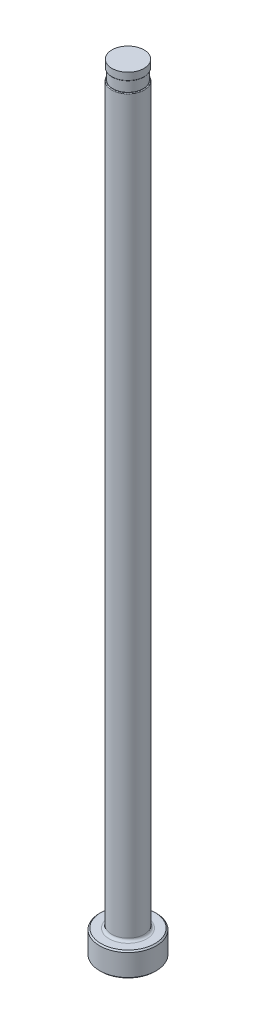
ISO-10303-21;
HEADER;
FILE_DESCRIPTION(('STEP AP214'),'2;1');
FILE_NAME('part.step','',(''),(''),'','','');
FILE_SCHEMA(('AUTOMOTIVE_DESIGN { 1 0 10303 214 1 1 1 1 }'));
ENDSEC;
DATA;
#1=APPLICATION_CONTEXT('core data for automotive mechanical design processes');
#2=APPLICATION_PROTOCOL_DEFINITION('international standard','automotive_design',2000,#1);
#3=PRODUCT_CONTEXT('',#1,'mechanical');
#4=PRODUCT('Part','Part','',(#3));
#5=PRODUCT_RELATED_PRODUCT_CATEGORY('part','',(#4));
#6=PRODUCT_DEFINITION_FORMATION('','',#4);
#7=PRODUCT_DEFINITION_CONTEXT('part definition',#1,'design');
#8=PRODUCT_DEFINITION('design','',#6,#7);
#9=PRODUCT_DEFINITION_SHAPE('','',#8);
#10=(LENGTH_UNIT() NAMED_UNIT(*) SI_UNIT(.MILLI.,.METRE.));
#11=(NAMED_UNIT(*) PLANE_ANGLE_UNIT() SI_UNIT($,.RADIAN.));
#12=(NAMED_UNIT(*) SI_UNIT($,.STERADIAN.) SOLID_ANGLE_UNIT());
#13=UNCERTAINTY_MEASURE_WITH_UNIT(LENGTH_MEASURE(1.E-05),#10,'distance_accuracy_value','');
#14=(GEOMETRIC_REPRESENTATION_CONTEXT(3) GLOBAL_UNCERTAINTY_ASSIGNED_CONTEXT((#13)) GLOBAL_UNIT_ASSIGNED_CONTEXT((#10,
#11,#12)) REPRESENTATION_CONTEXT('',''));
#15=CARTESIAN_POINT('',(0.,0.,0.));
#16=DIRECTION('',(0.,0.,1.));
#17=DIRECTION('',(1.,0.,0.));
#18=AXIS2_PLACEMENT_3D('',#15,#16,#17);
#19=CARTESIAN_POINT('',(-3.17499999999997,150.876,0.));
#20=DIRECTION('',(0.,1.,0.));
#21=DIRECTION('',(0.,0.,1.));
#22=AXIS2_PLACEMENT_3D('',#19,#20,#21);
#23=PLANE('',#22);
#24=CARTESIAN_POINT('',(0.,150.876,0.));
#25=DIRECTION('',(0.,1.,0.));
#26=DIRECTION('',(0.,0.,1.));
#27=AXIS2_PLACEMENT_3D('',#24,#25,#26);
#28=CIRCLE('',#27,3.02259999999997);
#29=CARTESIAN_POINT('',(0.,150.876,3.02259999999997));
#30=VERTEX_POINT('',#29);
#31=EDGE_CURVE('E11',#30,#30,#28,.F.);
#32=ORIENTED_EDGE('',*,*,#31,.T.);
#33=EDGE_LOOP('',(#32));
#34=FACE_BOUND('',#33,.T.);
#35=CARTESIAN_POINT('',(0.,150.876,0.));
#36=DIRECTION('',(0.,1.,0.));
#37=DIRECTION('',(0.,0.,1.));
#38=AXIS2_PLACEMENT_3D('',#35,#36,#37);
#39=CIRCLE('',#38,2.97179999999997);
#40=CARTESIAN_POINT('',(0.,150.876,2.97179999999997));
#41=VERTEX_POINT('',#40);
#42=EDGE_CURVE('E78',#41,#41,#39,.T.);
#43=ORIENTED_EDGE('',*,*,#42,.T.);
#44=EDGE_LOOP('',(#43));
#45=FACE_BOUND('',#44,.T.);
#46=ADVANCED_FACE('F36',(#34,#45),#23,.F.);
#47=CARTESIAN_POINT('',(0.,259.958771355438,0.));
#48=DIRECTION('',(0.,1.,0.));
#49=DIRECTION('',(0.,0.,1.));
#50=AXIS2_PLACEMENT_3D('',#47,#48,#49);
#51=CYLINDRICAL_SURFACE('',#50,3.17499999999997);
#52=DIRECTION('',(0.,1.,0.));
#53=VECTOR('',#52,1.);
#54=CARTESIAN_POINT('',(-2.97179999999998,259.958771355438,-1.11759999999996));
#55=LINE('',#54,#53);
#56=CARTESIAN_POINT('',(-2.97179999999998,148.717,-1.11759999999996));
#57=VERTEX_POINT('',#56);
#58=CARTESIAN_POINT('',(-2.97179999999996,86.36,-1.11760000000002));
#59=VERTEX_POINT('',#58);
#60=EDGE_CURVE('E73',#57,#59,#55,.F.);
#61=ORIENTED_EDGE('',*,*,#60,.F.);
#62=CARTESIAN_POINT('',(0.,148.717,0.));
#63=DIRECTION('',(0.,-1.,0.));
#64=DIRECTION('',(0.,0.,-1.));
#65=AXIS2_PLACEMENT_3D('',#62,#63,#64);
#66=CIRCLE('',#65,3.17499999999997);
#67=CARTESIAN_POINT('',(-2.97179999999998,148.717,1.11759999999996));
#68=VERTEX_POINT('',#67);
#69=EDGE_CURVE('E51',#57,#68,#66,.T.);
#70=ORIENTED_EDGE('',*,*,#69,.T.);
#71=DIRECTION('',(0.,1.,0.));
#72=VECTOR('',#71,1.);
#73=CARTESIAN_POINT('',(-2.97179999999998,259.958771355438,1.11759999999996));
#74=LINE('',#73,#72);
#75=CARTESIAN_POINT('',(-2.97179999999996,86.36,1.11760000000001));
#76=VERTEX_POINT('',#75);
#77=EDGE_CURVE('E84',#76,#68,#74,.T.);
#78=ORIENTED_EDGE('',*,*,#77,.F.);
#79=CARTESIAN_POINT('',(-2.97179999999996,86.36,-1.11760000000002));
#80=CARTESIAN_POINT('',(-2.97179783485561,86.3288492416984,-1.11759841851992));
#81=CARTESIAN_POINT('',(-2.97225900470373,86.2977131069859,-1.11638031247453));
#82=CARTESIAN_POINT('',(-2.97408412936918,86.2356581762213,-1.11151181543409));
#83=CARTESIAN_POINT('',(-2.9754480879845,86.2047393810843,-1.10786141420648));
#84=CARTESIAN_POINT('',(-2.98085437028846,86.1126586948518,-1.09327356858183));
#85=CARTESIAN_POINT('',(-2.98621120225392,86.0521035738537,-1.07869946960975));
#86=CARTESIAN_POINT('',(-2.99989040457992,85.9344361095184,-1.0400472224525));
#87=CARTESIAN_POINT('',(-3.0082151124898,85.877326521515,-1.01596158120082));
#88=CARTESIAN_POINT('',(-3.02694285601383,85.7682418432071,-0.958720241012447));
#89=CARTESIAN_POINT('',(-3.03734492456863,85.7162643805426,-0.925568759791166));
#90=CARTESIAN_POINT('',(-3.0590244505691,85.6192383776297,-0.851164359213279));
#91=CARTESIAN_POINT('',(-3.07029576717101,85.574146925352,-0.809965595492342));
#92=CARTESIAN_POINT('',(-3.09254226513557,85.4916893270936,-0.720370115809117));
#93=CARTESIAN_POINT('',(-3.10351739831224,85.4543244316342,-0.67197223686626));
#94=CARTESIAN_POINT('',(-3.12390298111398,85.3884529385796,-0.569694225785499));
#95=CARTESIAN_POINT('',(-3.13332395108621,85.3598855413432,-0.515855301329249));
#96=CARTESIAN_POINT('',(-3.14970808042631,85.3118047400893,-0.403931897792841));
#97=CARTESIAN_POINT('',(-3.15667118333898,85.2922915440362,-0.345847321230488));
#98=CARTESIAN_POINT('',(-3.16748231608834,85.2624813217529,-0.226501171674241));
#99=CARTESIAN_POINT('',(-3.171300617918,85.2522721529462,-0.16521497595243));
#100=CARTESIAN_POINT('',(-3.17532797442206,85.2415133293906,-0.0416799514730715));
#101=CARTESIAN_POINT('',(-3.17553664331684,85.2409647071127,0.0205689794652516));
#102=CARTESIAN_POINT('',(-3.17230405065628,85.2495855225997,0.145017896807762));
#103=CARTESIAN_POINT('',(-3.16882082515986,85.2588666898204,0.207209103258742));
#104=CARTESIAN_POINT('',(-3.15849643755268,85.2872036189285,0.329033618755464));
#105=CARTESIAN_POINT('',(-3.15165544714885,85.3062588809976,0.388667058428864));
#106=CARTESIAN_POINT('',(-3.13536379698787,85.3537683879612,0.503459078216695));
#107=CARTESIAN_POINT('',(-3.12592155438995,85.3821923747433,0.558631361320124));
#108=CARTESIAN_POINT('',(-3.10544176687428,85.4478905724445,0.663093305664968));
#109=CARTESIAN_POINT('',(-3.0944044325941,85.4851636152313,0.712383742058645));
#110=CARTESIAN_POINT('',(-3.07210838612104,85.567112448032,0.803076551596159));
#111=CARTESIAN_POINT('',(-3.06085457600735,85.611683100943,0.844575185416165));
#112=CARTESIAN_POINT('',(-3.03920760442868,85.7073924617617,0.919437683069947));
#113=CARTESIAN_POINT('',(-3.02881454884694,85.758531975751,0.95280054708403));
#114=CARTESIAN_POINT('',(-3.01003274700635,85.8657633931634,1.01056985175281));
#115=CARTESIAN_POINT('',(-3.00163816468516,85.9218402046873,1.03500248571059));
#116=CARTESIAN_POINT('',(-2.987687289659,86.0374874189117,1.0746137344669));
#117=CARTESIAN_POINT('',(-2.98212915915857,86.0970555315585,1.08979834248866));
#118=CARTESIAN_POINT('',(-2.97612776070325,86.1909133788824,1.10603958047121));
#119=CARTESIAN_POINT('',(-2.97450869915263,86.224597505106,1.11037745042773));
#120=CARTESIAN_POINT('',(-2.97234395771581,86.2921830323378,1.11615426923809));
#121=CARTESIAN_POINT('',(-2.97179623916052,86.3260838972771,1.1175987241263));
#122=CARTESIAN_POINT('',(-2.97179999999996,86.36,1.11760000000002));
#123=B_SPLINE_CURVE_WITH_KNOTS('',3,(#79,#80,#81,#82,#83,#84,#85,#86,#87,#88,#89,#90,#91,#92,
#93,#94,#95,#96,#97,#98,#99,#100,#101,#102,#103,#104,#105,#106,#107,#108,#109,#110,#111,#112,
#113,#114,#115,#116,#117,#118,#119,#120,#121,#122),.UNSPECIFIED.,.F.,.F.,(4,2,2,2,2,2,2,2,2,2,2,
2,2,2,2,2,2,2,2,2,2,4),(0.,0.0933958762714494,0.186792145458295,0.373380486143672,
0.560116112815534,0.746765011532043,0.932198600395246,1.11766217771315,1.30181365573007,
1.48596936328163,1.67184654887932,1.85774359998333,2.04577654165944,2.23379986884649,
2.42122179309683,2.60861899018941,2.79352185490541,2.97844743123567,3.16282616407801,
3.34708528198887,3.448962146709,3.55064495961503),.UNSPECIFIED.);
#124=EDGE_CURVE('E81',#59,#76,#123,.T.);
#125=ORIENTED_EDGE('',*,*,#124,.F.);
#126=EDGE_LOOP('',(#61,#70,#78,#125));
#127=FACE_BOUND('',#126,.T.);
#128=CARTESIAN_POINT('',(0.,5.25779999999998,0.));
#129=DIRECTION('',(0.,1.,0.));
#130=DIRECTION('',(0.,0.,1.));
#131=AXIS2_PLACEMENT_3D('',#128,#129,#130);
#132=CIRCLE('',#131,3.17499999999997);
#133=CARTESIAN_POINT('',(0.,5.25779999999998,3.17499999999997));
#134=VERTEX_POINT('',#133);
#135=EDGE_CURVE('E116',#134,#134,#132,.T.);
#136=ORIENTED_EDGE('',*,*,#135,.T.);
#137=EDGE_LOOP('',(#136));
#138=FACE_BOUND('',#137,.T.);
#139=ADVANCED_FACE('F82',(#127,#138),#51,.T.);
#140=CARTESIAN_POINT('',(0.,0.,0.));
#141=DIRECTION('',(0.,-1.,0.));
#142=DIRECTION('',(0.,0.,-1.));
#143=AXIS2_PLACEMENT_3D('',#140,#141,#142);
#144=PLANE('',#143);
#145=CARTESIAN_POINT('',(0.,0.,0.));
#146=DIRECTION('',(0.,-1.,0.));
#147=DIRECTION('',(0.,0.,-1.));
#148=AXIS2_PLACEMENT_3D('',#145,#146,#147);
#149=CIRCLE('',#148,5.29589999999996);
#150=CARTESIAN_POINT('',(0.,0.,-5.29589999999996));
#151=VERTEX_POINT('',#150);
#152=EDGE_CURVE('E113',#151,#151,#149,.T.);
#153=ORIENTED_EDGE('',*,*,#152,.T.);
#154=EDGE_LOOP('',(#153));
#155=FACE_BOUND('',#154,.T.);
#156=ADVANCED_FACE('F192',(#155),#144,.T.);
#157=CARTESIAN_POINT('',(0.,259.958771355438,0.));
#158=DIRECTION('',(0.,1.,0.));
#159=DIRECTION('',(0.,0.,1.));
#160=AXIS2_PLACEMENT_3D('',#157,#158,#159);
#161=CYLINDRICAL_SURFACE('',#160,5.54989999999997);
#162=CARTESIAN_POINT('',(0.,4.49579999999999,0.));
#163=DIRECTION('',(0.,1.,0.));
#164=DIRECTION('',(0.,0.,1.));
#165=AXIS2_PLACEMENT_3D('',#162,#163,#164);
#166=CIRCLE('',#165,5.54989999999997);
#167=CARTESIAN_POINT('',(0.,4.49579999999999,5.54989999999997));
#168=VERTEX_POINT('',#167);
#169=EDGE_CURVE('E110',#168,#168,#166,.F.);
#170=ORIENTED_EDGE('',*,*,#169,.T.);
#171=EDGE_LOOP('',(#170));
#172=FACE_BOUND('',#171,.T.);
#173=CARTESIAN_POINT('',(0.,0.253999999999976,0.));
#174=DIRECTION('',(0.,-1.,0.));
#175=DIRECTION('',(0.,0.,-1.));
#176=AXIS2_PLACEMENT_3D('',#173,#174,#175);
#177=CIRCLE('',#176,5.54989999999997);
#178=CARTESIAN_POINT('',(0.,0.253999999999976,-5.54989999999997));
#179=VERTEX_POINT('',#178);
#180=EDGE_CURVE('E107',#179,#179,#177,.F.);
#181=ORIENTED_EDGE('',*,*,#180,.T.);
#182=EDGE_LOOP('',(#181));
#183=FACE_BOUND('',#182,.T.);
#184=ADVANCED_FACE('F195',(#172,#183),#161,.T.);
#185=CARTESIAN_POINT('',(-5.54989999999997,4.7498,0.));
#186=DIRECTION('',(0.,1.,0.));
#187=DIRECTION('',(0.,0.,1.));
#188=AXIS2_PLACEMENT_3D('',#185,#186,#187);
#189=PLANE('',#188);
#190=CARTESIAN_POINT('',(0.,4.7498,0.));
#191=DIRECTION('',(0.,1.,0.));
#192=DIRECTION('',(0.,0.,1.));
#193=AXIS2_PLACEMENT_3D('',#190,#191,#192);
#194=CIRCLE('',#193,3.68299999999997);
#195=CARTESIAN_POINT('',(0.,4.7498,3.68299999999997));
#196=VERTEX_POINT('',#195);
#197=EDGE_CURVE('E87',#196,#196,#194,.F.);
#198=ORIENTED_EDGE('',*,*,#197,.T.);
#199=EDGE_LOOP('',(#198));
#200=FACE_BOUND('',#199,.T.);
#201=CARTESIAN_POINT('',(0.,4.7498,0.));
#202=DIRECTION('',(0.,1.,0.));
#203=DIRECTION('',(0.,0.,1.));
#204=AXIS2_PLACEMENT_3D('',#201,#202,#203);
#205=CIRCLE('',#204,5.29589999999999);
#206=CARTESIAN_POINT('',(0.,4.7498,5.29589999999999));
#207=VERTEX_POINT('',#206);
#208=EDGE_CURVE('E104',#207,#207,#205,.T.);
#209=ORIENTED_EDGE('',*,*,#208,.T.);
#210=EDGE_LOOP('',(#209));
#211=FACE_BOUND('',#210,.T.);
#212=ADVANCED_FACE('F190',(#200,#211),#189,.T.);
#213=CARTESIAN_POINT('',(0.,4.74980000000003,0.));
#214=DIRECTION('',(0.,-1.,0.));
#215=DIRECTION('',(0.,0.,-1.));
#216=AXIS2_PLACEMENT_3D('',#213,#214,#215);
#217=CONICAL_SURFACE('',#216,5.29589999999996,0.785398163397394);
#218=ORIENTED_EDGE('',*,*,#169,.F.);
#219=EDGE_LOOP('',(#218));
#220=FACE_BOUND('',#219,.T.);
#221=ORIENTED_EDGE('',*,*,#208,.F.);
#222=EDGE_LOOP('',(#221));
#223=FACE_BOUND('',#222,.T.);
#224=ADVANCED_FACE('F186',(#220,#223),#217,.T.);
#225=CARTESIAN_POINT('',(0.,0.253999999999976,0.));
#226=DIRECTION('',(0.,1.,0.));
#227=DIRECTION('',(0.,0.,1.));
#228=AXIS2_PLACEMENT_3D('',#225,#226,#227);
#229=CONICAL_SURFACE('',#228,5.54989999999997,0.785398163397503);
#230=ORIENTED_EDGE('',*,*,#152,.F.);
#231=EDGE_LOOP('',(#230));
#232=FACE_BOUND('',#231,.T.);
#233=ORIENTED_EDGE('',*,*,#180,.F.);
#234=EDGE_LOOP('',(#233));
#235=FACE_BOUND('',#234,.T.);
#236=ADVANCED_FACE('F182',(#232,#235),#229,.T.);
#237=CARTESIAN_POINT('',(0.,5.25779999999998,0.));
#238=DIRECTION('',(0.,1.,0.));
#239=DIRECTION('',(0.,0.,1.));
#240=AXIS2_PLACEMENT_3D('',#237,#238,#239);
#241=TOROIDAL_SURFACE('',#240,3.68299999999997,0.508);
#242=ORIENTED_EDGE('',*,*,#197,.F.);
#243=EDGE_LOOP('',(#242));
#244=FACE_BOUND('',#243,.T.);
#245=ORIENTED_EDGE('',*,*,#135,.F.);
#246=EDGE_LOOP('',(#245));
#247=FACE_BOUND('',#246,.T.);
#248=ADVANCED_FACE('F147',(#244,#247),#241,.F.);
#249=CARTESIAN_POINT('',(-3.17499999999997,148.844,0.));
#250=DIRECTION('',(0.,-1.,0.));
#251=DIRECTION('',(0.,0.,-1.));
#252=AXIS2_PLACEMENT_3D('',#249,#250,#251);
#253=PLANE('',#252);
#254=DIRECTION('',(0.,0.,1.));
#255=VECTOR('',#254,1.);
#256=CARTESIAN_POINT('',(-2.97179999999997,148.844,0.));
#257=LINE('',#256,#255);
#258=CARTESIAN_POINT('',(-2.97179999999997,148.844,0.));
#259=VERTEX_POINT('',#258);
#260=CARTESIAN_POINT('',(-2.97179999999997,148.844,0.677280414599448));
#261=VERTEX_POINT('',#260);
#262=EDGE_CURVE('E90',#259,#261,#257,.T.);
#263=ORIENTED_EDGE('',*,*,#262,.T.);
#264=CARTESIAN_POINT('',(0.,148.844,0.));
#265=DIRECTION('',(0.,-1.,0.));
#266=DIRECTION('',(0.,0.,-1.));
#267=AXIS2_PLACEMENT_3D('',#264,#265,#266);
#268=CIRCLE('',#267,3.04799999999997);
#269=CARTESIAN_POINT('',(-2.97179999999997,148.844,-0.677280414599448));
#270=VERTEX_POINT('',#269);
#271=EDGE_CURVE('E86',#261,#270,#268,.F.);
#272=ORIENTED_EDGE('',*,*,#271,.T.);
#273=EDGE_CURVE('E79',#270,#259,#257,.T.);
#274=ORIENTED_EDGE('',*,*,#273,.T.);
#275=CARTESIAN_POINT('',(0.,148.844,0.));
#276=DIRECTION('',(0.,1.,0.));
#277=DIRECTION('',(0.,0.,1.));
#278=AXIS2_PLACEMENT_3D('',#275,#276,#277);
#279=CIRCLE('',#278,2.97179999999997);
#280=EDGE_CURVE('E101',#259,#259,#279,.T.);
#281=ORIENTED_EDGE('',*,*,#280,.F.);
#282=EDGE_LOOP('',(#263,#272,#274,#281));
#283=FACE_BOUND('',#282,.T.);
#284=ADVANCED_FACE('F144',(#283),#253,.F.);
#285=CARTESIAN_POINT('',(0.,153.448281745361,0.));
#286=DIRECTION('',(0.,1.,0.));
#287=DIRECTION('',(0.,0.,1.));
#288=AXIS2_PLACEMENT_3D('',#285,#286,#287);
#289=CYLINDRICAL_SURFACE('',#288,2.97179999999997);
#290=ORIENTED_EDGE('',*,*,#42,.F.);
#291=EDGE_LOOP('',(#290));
#292=FACE_BOUND('',#291,.T.);
#293=ORIENTED_EDGE('',*,*,#280,.T.);
#294=EDGE_LOOP('',(#293));
#295=FACE_BOUND('',#294,.T.);
#296=ADVANCED_FACE('F141',(#292,#295),#289,.T.);
#297=CARTESIAN_POINT('',(-2.97179999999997,149.86,-5.54989999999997));
#298=DIRECTION('',(1.,0.,0.));
#299=DIRECTION('',(0.,1.,0.));
#300=AXIS2_PLACEMENT_3D('',#297,#298,#299);
#301=PLANE('',#300);
#302=ORIENTED_EDGE('',*,*,#273,.F.);
#303=CARTESIAN_POINT('',(-2.97179999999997,148.844,-0.677280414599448));
#304=CARTESIAN_POINT('',(-2.97179999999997,148.843991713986,-0.698495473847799));
#305=CARTESIAN_POINT('',(-2.97179999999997,148.843736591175,-0.719716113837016));
#306=CARTESIAN_POINT('',(-2.97179999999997,148.842538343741,-0.762179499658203));
#307=CARTESIAN_POINT('',(-2.97179999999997,148.841593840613,-0.78342220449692));
#308=CARTESIAN_POINT('',(-2.97179999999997,148.838820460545,-0.825863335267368));
#309=CARTESIAN_POINT('',(-2.97179999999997,148.836991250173,-0.847061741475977));
#310=CARTESIAN_POINT('',(-2.97179999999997,148.832151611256,-0.889310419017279));
#311=CARTESIAN_POINT('',(-2.97179999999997,148.829141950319,-0.910360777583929));
#312=CARTESIAN_POINT('',(-2.97179999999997,148.821222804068,-0.953695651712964));
#313=CARTESIAN_POINT('',(-2.97179999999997,148.816192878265,-0.975960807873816));
#314=CARTESIAN_POINT('',(-2.97179999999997,148.806052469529,-1.00993113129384));
#315=CARTESIAN_POINT('',(-2.97179999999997,148.801967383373,-1.02193961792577));
#316=CARTESIAN_POINT('',(-2.97179999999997,148.792509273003,-1.04542724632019));
#317=CARTESIAN_POINT('',(-2.97179999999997,148.787141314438,-1.0569082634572));
#318=CARTESIAN_POINT('',(-2.97179999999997,148.778361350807,-1.07197645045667));
#319=CARTESIAN_POINT('',(-2.97179999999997,148.775794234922,-1.07605240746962));
#320=CARTESIAN_POINT('',(-2.97179999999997,148.770297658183,-1.08396863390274));
#321=CARTESIAN_POINT('',(-2.97179999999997,148.767367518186,-1.08780844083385));
#322=CARTESIAN_POINT('',(-2.97179999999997,148.761038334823,-1.09516229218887));
#323=CARTESIAN_POINT('',(-2.97179999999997,148.75763441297,-1.09867221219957));
#324=CARTESIAN_POINT('',(-2.97179999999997,148.750296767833,-1.10509067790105));
#325=CARTESIAN_POINT('',(-2.97179999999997,148.746365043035,-1.10800139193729));
#326=CARTESIAN_POINT('',(-2.97179999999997,148.739688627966,-1.11185537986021));
#327=CARTESIAN_POINT('',(-2.97179999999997,148.737127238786,-1.11311410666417));
#328=CARTESIAN_POINT('',(-2.97179999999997,148.731839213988,-1.11520642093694));
#329=CARTESIAN_POINT('',(-2.97179999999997,148.729113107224,-1.11604129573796));
#330=CARTESIAN_POINT('',(-2.97179999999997,148.72480351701,-1.11694468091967));
#331=CARTESIAN_POINT('',(-2.97179999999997,148.723255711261,-1.11718896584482));
#332=CARTESIAN_POINT('',(-2.97179999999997,148.720139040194,-1.11751723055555));
#333=CARTESIAN_POINT('',(-2.97179999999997,148.718570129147,-1.11760077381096));
#334=CARTESIAN_POINT('',(-2.97179999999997,148.717,-1.11760000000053));
#335=B_SPLINE_CURVE_WITH_KNOTS('',3,(#303,#304,#305,#306,#307,#308,#309,#310,#311,#312,#313,
#314,#315,#316,#317,#318,#319,#320,#321,#322,#323,#324,#325,#326,#327,#328,#329,#330,#331,#332,
#333,#334),.UNSPECIFIED.,.F.,.F.,(4,2,2,2,2,2,2,2,2,2,2,2,2,2,2,4),(0.,0.0636519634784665,
0.127431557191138,0.191235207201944,0.254997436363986,0.32331819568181,0.361333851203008,
0.39920180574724,0.413638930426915,0.428103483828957,0.442729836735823,0.457302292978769,
0.465835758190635,0.474343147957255,0.479036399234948,0.483742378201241),.UNSPECIFIED.);
#336=EDGE_CURVE('E59',#270,#57,#335,.T.);
#337=ORIENTED_EDGE('',*,*,#336,.T.);
#338=ORIENTED_EDGE('',*,*,#60,.T.);
#339=DIRECTION('',(0.,0.,1.));
#340=VECTOR('',#339,1.);
#341=CARTESIAN_POINT('',(-2.97179999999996,86.36,-5.54989999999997));
#342=LINE('',#341,#340);
#343=EDGE_CURVE('E77',#59,#76,#342,.T.);
#344=ORIENTED_EDGE('',*,*,#343,.T.);
#345=ORIENTED_EDGE('',*,*,#77,.T.);
#346=CARTESIAN_POINT('',(-2.97179999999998,148.717,1.11759999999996));
#347=CARTESIAN_POINT('',(-2.97179999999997,148.719844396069,1.11760835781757));
#348=CARTESIAN_POINT('',(-2.97179999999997,148.72267736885,1.11732895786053));
#349=CARTESIAN_POINT('',(-2.97179999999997,148.728214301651,1.11627315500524));
#350=CARTESIAN_POINT('',(-2.97179999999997,148.730919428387,1.11550297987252));
#351=CARTESIAN_POINT('',(-2.97179999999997,148.736802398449,1.11330388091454));
#352=CARTESIAN_POINT('',(-2.97179999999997,148.739936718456,1.11176081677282));
#353=CARTESIAN_POINT('',(-2.97179999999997,148.74592747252,1.10819062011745));
#354=CARTESIAN_POINT('',(-2.97179999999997,148.748782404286,1.10616105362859));
#355=CARTESIAN_POINT('',(-2.97179999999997,148.756003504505,1.10031059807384));
#356=CARTESIAN_POINT('',(-2.97179999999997,148.760124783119,1.09619100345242));
#357=CARTESIAN_POINT('',(-2.97179999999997,148.767733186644,1.0874137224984));
#358=CARTESIAN_POINT('',(-2.97179999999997,148.771218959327,1.08275492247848));
#359=CARTESIAN_POINT('',(-2.97179999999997,148.782988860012,1.06527198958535));
#360=CARTESIAN_POINT('',(-2.97179999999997,148.789843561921,1.0515049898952));
#361=CARTESIAN_POINT('',(-2.97179999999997,148.801670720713,1.02308851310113));
#362=CARTESIAN_POINT('',(-2.97179999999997,148.806618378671,1.00843010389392));
#363=CARTESIAN_POINT('',(-2.97179999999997,148.818630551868,0.96688378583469));
#364=CARTESIAN_POINT('',(-2.97179999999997,148.824231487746,0.939575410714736));
#365=CARTESIAN_POINT('',(-2.97179999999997,148.832982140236,0.884515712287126));
#366=CARTESIAN_POINT('',(-2.97179999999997,148.836121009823,0.856762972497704));
#367=CARTESIAN_POINT('',(-2.97179999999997,148.840504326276,0.803619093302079));
#368=CARTESIAN_POINT('',(-2.97179999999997,148.841893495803,0.778239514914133));
#369=CARTESIAN_POINT('',(-2.97179999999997,148.843627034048,0.727660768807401));
#370=CARTESIAN_POINT('',(-2.97179999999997,148.843980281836,0.702461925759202));
#371=CARTESIAN_POINT('',(-2.97179999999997,148.844,0.67728041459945));
#372=B_SPLINE_CURVE_WITH_KNOTS('',3,(#346,#347,#348,#349,#350,#351,#352,#353,#354,#355,#356,
#357,#358,#359,#360,#361,#362,#363,#364,#365,#366,#367,#368,#369,#370,#371),.UNSPECIFIED.,.F.,
.F.,(4,2,2,2,2,2,2,2,2,2,2,2,4),(0.,0.0085011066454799,0.0168964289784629,0.0273183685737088,
0.0377935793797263,0.0551763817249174,0.0725957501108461,0.11838052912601,0.164742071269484,
0.248117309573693,0.331857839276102,0.408083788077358,0.483654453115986),.UNSPECIFIED.);
#373=EDGE_CURVE('E172',#68,#261,#372,.T.);
#374=ORIENTED_EDGE('',*,*,#373,.T.);
#375=ORIENTED_EDGE('',*,*,#262,.F.);
#376=EDGE_LOOP('',(#302,#337,#338,#344,#345,#374,#375));
#377=FACE_BOUND('',#376,.T.);
#378=ADVANCED_FACE('F75',(#377),#301,.F.);
#379=CARTESIAN_POINT('',(-6.14679999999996,86.36,-5.54989999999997));
#380=DIRECTION('',(0.,0.,1.));
#381=DIRECTION('',(1.,0.,0.));
#382=AXIS2_PLACEMENT_3D('',#379,#380,#381);
#383=CYLINDRICAL_SURFACE('',#382,3.175);
#384=ORIENTED_EDGE('',*,*,#343,.F.);
#385=ORIENTED_EDGE('',*,*,#124,.T.);
#386=EDGE_LOOP('',(#384,#385));
#387=FACE_BOUND('',#386,.T.);
#388=ADVANCED_FACE('F89',(#387),#383,.F.);
#389=CARTESIAN_POINT('',(0.,152.687735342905,0.));
#390=DIRECTION('',(0.,1.,0.));
#391=DIRECTION('',(0.,0.,1.));
#392=AXIS2_PLACEMENT_3D('',#389,#390,#391);
#393=CYLINDRICAL_SURFACE('',#392,3.14959999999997);
#394=CARTESIAN_POINT('',(0.,151.003,0.));
#395=DIRECTION('',(0.,1.,0.));
#396=DIRECTION('',(0.,0.,1.));
#397=AXIS2_PLACEMENT_3D('',#394,#395,#396);
#398=CIRCLE('',#397,3.14959999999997);
#399=CARTESIAN_POINT('',(0.,151.003,3.14959999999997));
#400=VERTEX_POINT('',#399);
#401=EDGE_CURVE('E44',#400,#400,#398,.T.);
#402=ORIENTED_EDGE('',*,*,#401,.T.);
#403=EDGE_LOOP('',(#402));
#404=FACE_BOUND('',#403,.T.);
#405=CARTESIAN_POINT('',(0.,152.4,0.));
#406=DIRECTION('',(0.,1.,0.));
#407=DIRECTION('',(0.,0.,1.));
#408=AXIS2_PLACEMENT_3D('',#405,#406,#407);
#409=CIRCLE('',#408,3.14959999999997);
#410=CARTESIAN_POINT('',(0.,152.4,3.14959999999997));
#411=VERTEX_POINT('',#410);
#412=EDGE_CURVE('E91',#411,#411,#409,.T.);
#413=ORIENTED_EDGE('',*,*,#412,.F.);
#414=EDGE_LOOP('',(#413));
#415=FACE_BOUND('',#414,.T.);
#416=ADVANCED_FACE('F135',(#404,#415),#393,.T.);
#417=CARTESIAN_POINT('',(-3.17499999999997,152.4,0.));
#418=DIRECTION('',(0.,1.,0.));
#419=DIRECTION('',(0.,0.,1.));
#420=AXIS2_PLACEMENT_3D('',#417,#418,#419);
#421=PLANE('',#420);
#422=ORIENTED_EDGE('',*,*,#412,.T.);
#423=EDGE_LOOP('',(#422));
#424=FACE_BOUND('',#423,.T.);
#425=ADVANCED_FACE('F149',(#424),#421,.T.);
#426=CARTESIAN_POINT('',(0.,148.717,0.));
#427=DIRECTION('',(0.,-1.,0.));
#428=DIRECTION('',(0.,0.,-1.));
#429=AXIS2_PLACEMENT_3D('',#426,#427,#428);
#430=TOROIDAL_SURFACE('',#429,3.04799999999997,0.127);
#431=ORIENTED_EDGE('',*,*,#373,.F.);
#432=ORIENTED_EDGE('',*,*,#69,.F.);
#433=ORIENTED_EDGE('',*,*,#336,.F.);
#434=ORIENTED_EDGE('',*,*,#271,.F.);
#435=EDGE_LOOP('',(#431,#432,#433,#434));
#436=FACE_BOUND('',#435,.T.);
#437=ADVANCED_FACE('F151',(#436),#430,.T.);
#438=CARTESIAN_POINT('',(0.,151.003,0.));
#439=DIRECTION('',(0.,1.,0.));
#440=DIRECTION('',(0.,0.,1.));
#441=AXIS2_PLACEMENT_3D('',#438,#439,#440);
#442=TOROIDAL_SURFACE('',#441,3.02259999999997,0.127);
#443=ORIENTED_EDGE('',*,*,#31,.F.);
#444=EDGE_LOOP('',(#443));
#445=FACE_BOUND('',#444,.T.);
#446=ORIENTED_EDGE('',*,*,#401,.F.);
#447=EDGE_LOOP('',(#446));
#448=FACE_BOUND('',#447,.T.);
#449=ADVANCED_FACE('F38',(#445,#448),#442,.T.);
#450=CLOSED_SHELL('',(#46,#139,#156,#184,#212,#224,#236,#248,#284,#296,#378,#388,#416,#425,#437,#449));
#451=MANIFOLD_SOLID_BREP('B2',#450);
#452=ADVANCED_BREP_SHAPE_REPRESENTATION('',(#18,#451),#14);
#453=SHAPE_DEFINITION_REPRESENTATION(#9,#452);
ENDSEC;
END-ISO-10303-21;
